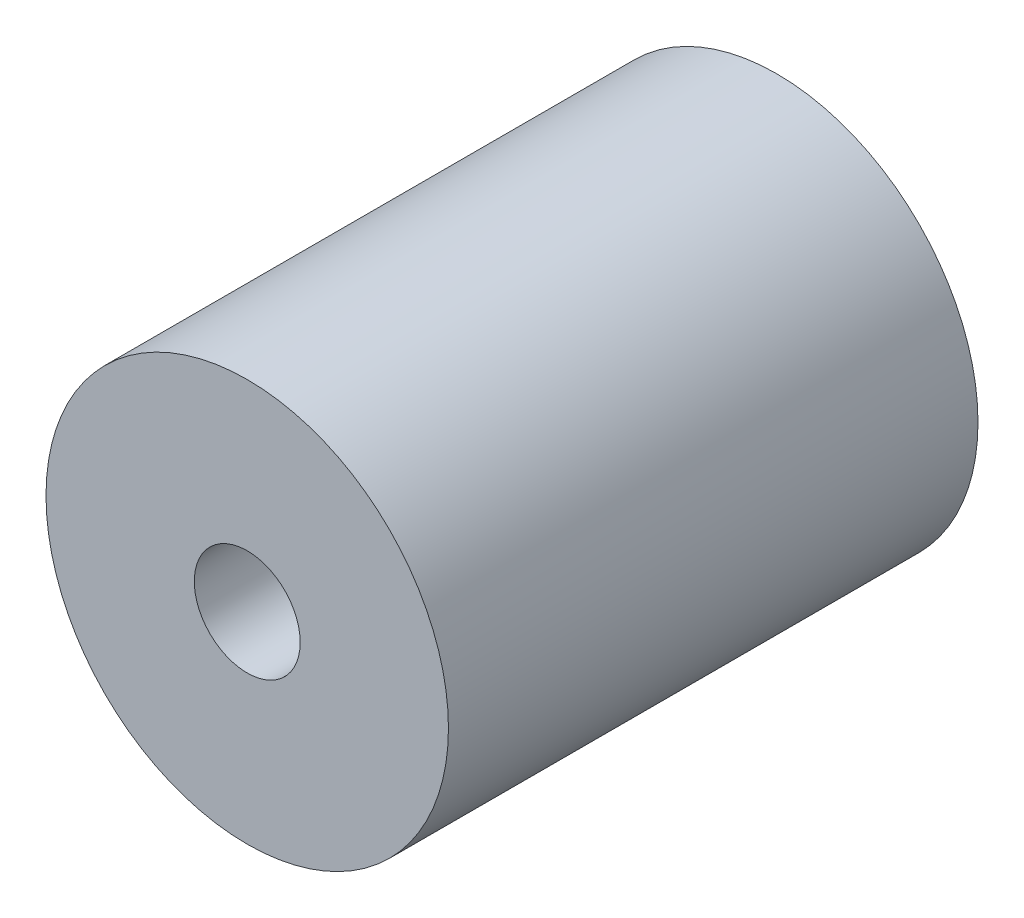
from build123d import *

# Parameters (mm, degrees)
CROQUIS1_R              = 9.5
CROQUIS1_R_2            = 2
SALIENTE_EXTRUIR1_DEPTH = 25
CROQUIS2_R              = 2.5
CORTAR_EXTRUIR1_DEPTH   = 15


with BuildPart() as part:
    # Croquis1 → Saliente-Extruir1 (new body)
    with BuildSketch(Plane.XY):
        Circle(CROQUIS1_R)
        Circle(CROQUIS1_R_2, mode=Mode.SUBTRACT)
    extrude(amount=SALIENTE_EXTRUIR1_DEPTH)

    # Croquis2 → Cortar-Extruir1 (cut)
    with BuildSketch(Plane.XY.offset(25)):
        Circle(CROQUIS2_R)
    extrude(amount=-CORTAR_EXTRUIR1_DEPTH, mode=Mode.SUBTRACT)


solid = part.part
